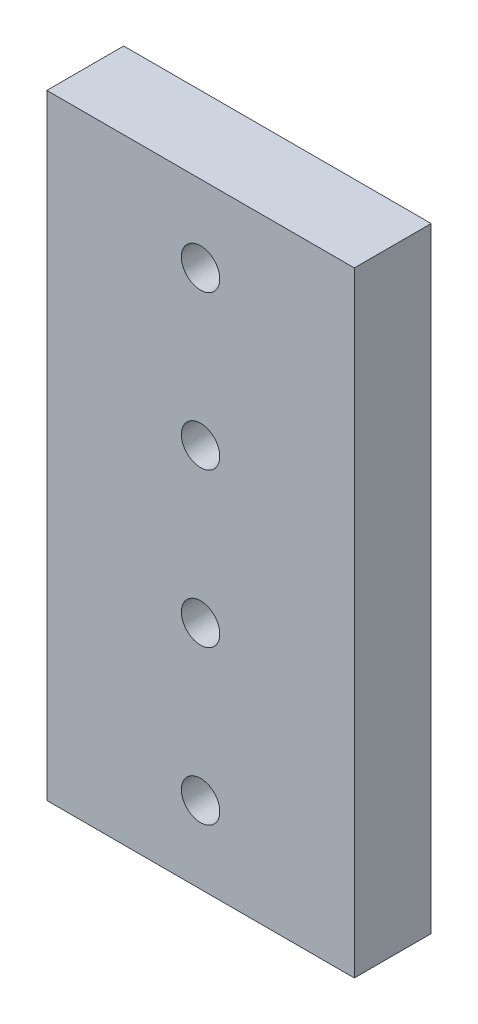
ISO-10303-21;
HEADER;
FILE_DESCRIPTION(('STEP AP214'),'2;1');
FILE_NAME('part.step','',(''),(''),'','','');
FILE_SCHEMA(('AUTOMOTIVE_DESIGN { 1 0 10303 214 1 1 1 1 }'));
ENDSEC;
DATA;
#1=APPLICATION_CONTEXT('core data for automotive mechanical design processes');
#2=APPLICATION_PROTOCOL_DEFINITION('international standard','automotive_design',2000,#1);
#3=PRODUCT_CONTEXT('',#1,'mechanical');
#4=PRODUCT('Part','Part','',(#3));
#5=PRODUCT_RELATED_PRODUCT_CATEGORY('part','',(#4));
#6=PRODUCT_DEFINITION_FORMATION('','',#4);
#7=PRODUCT_DEFINITION_CONTEXT('part definition',#1,'design');
#8=PRODUCT_DEFINITION('design','',#6,#7);
#9=PRODUCT_DEFINITION_SHAPE('','',#8);
#10=(LENGTH_UNIT() NAMED_UNIT(*) SI_UNIT(.MILLI.,.METRE.));
#11=(NAMED_UNIT(*) PLANE_ANGLE_UNIT() SI_UNIT($,.RADIAN.));
#12=(NAMED_UNIT(*) SI_UNIT($,.STERADIAN.) SOLID_ANGLE_UNIT());
#13=UNCERTAINTY_MEASURE_WITH_UNIT(LENGTH_MEASURE(1.E-05),#10,'distance_accuracy_value','');
#14=(GEOMETRIC_REPRESENTATION_CONTEXT(3) GLOBAL_UNCERTAINTY_ASSIGNED_CONTEXT((#13)) GLOBAL_UNIT_ASSIGNED_CONTEXT((#10,
#11,#12)) REPRESENTATION_CONTEXT('',''));
#15=CARTESIAN_POINT('',(0.,0.,0.));
#16=DIRECTION('',(0.,0.,1.));
#17=DIRECTION('',(1.,0.,0.));
#18=AXIS2_PLACEMENT_3D('',#15,#16,#17);
#19=CARTESIAN_POINT('',(12.7,-25.4,3.175));
#20=DIRECTION('',(-1.,0.,0.));
#21=DIRECTION('',(0.,0.,1.));
#22=AXIS2_PLACEMENT_3D('',#19,#20,#21);
#23=PLANE('',#22);
#24=DIRECTION('',(0.,1.,0.));
#25=VECTOR('',#24,1.);
#26=CARTESIAN_POINT('',(12.7,-25.4,-3.175));
#27=LINE('',#26,#25);
#28=CARTESIAN_POINT('',(12.7,-25.4,-3.175));
#29=VERTEX_POINT('',#28);
#30=CARTESIAN_POINT('',(12.7,25.4,-3.175));
#31=VERTEX_POINT('',#30);
#32=EDGE_CURVE('E102',#29,#31,#27,.T.);
#33=ORIENTED_EDGE('',*,*,#32,.T.);
#34=DIRECTION('',(0.,0.,-1.));
#35=VECTOR('',#34,1.);
#36=CARTESIAN_POINT('',(12.7,25.4,3.175));
#37=LINE('',#36,#35);
#38=CARTESIAN_POINT('',(12.7,25.4,3.175));
#39=VERTEX_POINT('',#38);
#40=EDGE_CURVE('E93',#39,#31,#37,.T.);
#41=ORIENTED_EDGE('',*,*,#40,.F.);
#42=DIRECTION('',(0.,1.,0.));
#43=VECTOR('',#42,1.);
#44=CARTESIAN_POINT('',(12.7,-25.4,3.175));
#45=LINE('',#44,#43);
#46=CARTESIAN_POINT('',(12.7,-25.4,3.175));
#47=VERTEX_POINT('',#46);
#48=EDGE_CURVE('E87',#47,#39,#45,.T.);
#49=ORIENTED_EDGE('',*,*,#48,.F.);
#50=DIRECTION('',(0.,0.,-1.));
#51=VECTOR('',#50,1.);
#52=CARTESIAN_POINT('',(12.7,-25.4,3.175));
#53=LINE('',#52,#51);
#54=EDGE_CURVE('E98',#47,#29,#53,.T.);
#55=ORIENTED_EDGE('',*,*,#54,.T.);
#56=EDGE_LOOP('',(#33,#41,#49,#55));
#57=FACE_BOUND('',#56,.T.);
#58=ADVANCED_FACE('F33',(#57),#23,.F.);
#59=CARTESIAN_POINT('',(-12.7,25.4,3.175));
#60=DIRECTION('',(0.,-1.,0.));
#61=DIRECTION('',(0.,0.,-1.));
#62=AXIS2_PLACEMENT_3D('',#59,#60,#61);
#63=PLANE('',#62);
#64=DIRECTION('',(-1.,0.,0.));
#65=VECTOR('',#64,1.);
#66=CARTESIAN_POINT('',(-12.7,25.4,-3.175));
#67=LINE('',#66,#65);
#68=CARTESIAN_POINT('',(-12.7,25.4,-3.175));
#69=VERTEX_POINT('',#68);
#70=EDGE_CURVE('E92',#31,#69,#67,.T.);
#71=ORIENTED_EDGE('',*,*,#70,.T.);
#72=DIRECTION('',(0.,0.,-1.));
#73=VECTOR('',#72,1.);
#74=CARTESIAN_POINT('',(-12.7,25.4,3.175));
#75=LINE('',#74,#73);
#76=CARTESIAN_POINT('',(-12.7,25.4,3.175));
#77=VERTEX_POINT('',#76);
#78=EDGE_CURVE('E90',#77,#69,#75,.T.);
#79=ORIENTED_EDGE('',*,*,#78,.F.);
#80=DIRECTION('',(-1.,0.,0.));
#81=VECTOR('',#80,1.);
#82=CARTESIAN_POINT('',(-12.7,25.4,3.175));
#83=LINE('',#82,#81);
#84=EDGE_CURVE('E81',#39,#77,#83,.T.);
#85=ORIENTED_EDGE('',*,*,#84,.F.);
#86=ORIENTED_EDGE('',*,*,#40,.T.);
#87=EDGE_LOOP('',(#71,#79,#85,#86));
#88=FACE_BOUND('',#87,.T.);
#89=ADVANCED_FACE('F91',(#88),#63,.F.);
#90=CARTESIAN_POINT('',(-12.7,-25.4,3.175));
#91=DIRECTION('',(1.,0.,0.));
#92=DIRECTION('',(0.,0.,-1.));
#93=AXIS2_PLACEMENT_3D('',#90,#91,#92);
#94=PLANE('',#93);
#95=DIRECTION('',(0.,-1.,0.));
#96=VECTOR('',#95,1.);
#97=CARTESIAN_POINT('',(-12.7,-25.4,-3.175));
#98=LINE('',#97,#96);
#99=CARTESIAN_POINT('',(-12.7,-25.4,-3.175));
#100=VERTEX_POINT('',#99);
#101=EDGE_CURVE('E67',#69,#100,#98,.T.);
#102=ORIENTED_EDGE('',*,*,#101,.T.);
#103=DIRECTION('',(0.,0.,-1.));
#104=VECTOR('',#103,1.);
#105=CARTESIAN_POINT('',(-12.7,-25.4,3.175));
#106=LINE('',#105,#104);
#107=CARTESIAN_POINT('',(-12.7,-25.4,3.175));
#108=VERTEX_POINT('',#107);
#109=EDGE_CURVE('E94',#108,#100,#106,.T.);
#110=ORIENTED_EDGE('',*,*,#109,.F.);
#111=DIRECTION('',(0.,-1.,0.));
#112=VECTOR('',#111,1.);
#113=CARTESIAN_POINT('',(-12.7,-25.4,3.175));
#114=LINE('',#113,#112);
#115=EDGE_CURVE('E85',#77,#108,#114,.T.);
#116=ORIENTED_EDGE('',*,*,#115,.F.);
#117=ORIENTED_EDGE('',*,*,#78,.T.);
#118=EDGE_LOOP('',(#102,#110,#116,#117));
#119=FACE_BOUND('',#118,.T.);
#120=ADVANCED_FACE('F96',(#119),#94,.F.);
#121=CARTESIAN_POINT('',(-12.7,-25.4,3.175));
#122=DIRECTION('',(0.,1.,0.));
#123=DIRECTION('',(0.,0.,1.));
#124=AXIS2_PLACEMENT_3D('',#121,#122,#123);
#125=PLANE('',#124);
#126=DIRECTION('',(1.,0.,0.));
#127=VECTOR('',#126,1.);
#128=CARTESIAN_POINT('',(-12.7,-25.4,-3.175));
#129=LINE('',#128,#127);
#130=EDGE_CURVE('E73',#100,#29,#129,.T.);
#131=ORIENTED_EDGE('',*,*,#130,.T.);
#132=ORIENTED_EDGE('',*,*,#54,.F.);
#133=DIRECTION('',(1.,0.,0.));
#134=VECTOR('',#133,1.);
#135=CARTESIAN_POINT('',(-12.7,-25.4,3.175));
#136=LINE('',#135,#134);
#137=EDGE_CURVE('E50',#108,#47,#136,.T.);
#138=ORIENTED_EDGE('',*,*,#137,.F.);
#139=ORIENTED_EDGE('',*,*,#109,.T.);
#140=EDGE_LOOP('',(#131,#132,#138,#139));
#141=FACE_BOUND('',#140,.T.);
#142=ADVANCED_FACE('F138',(#141),#125,.F.);
#143=CARTESIAN_POINT('',(0.,0.,3.175));
#144=DIRECTION('',(0.,0.,-1.));
#145=DIRECTION('',(-1.,0.,0.));
#146=AXIS2_PLACEMENT_3D('',#143,#144,#145);
#147=PLANE('',#146);
#148=CARTESIAN_POINT('',(0.,6.35,3.175));
#149=DIRECTION('',(0.,0.,-1.));
#150=DIRECTION('',(-1.,0.,0.));
#151=AXIS2_PLACEMENT_3D('',#148,#149,#150);
#152=CIRCLE('',#151,1.5875);
#153=CARTESIAN_POINT('',(-1.5875,6.35,3.175));
#154=VERTEX_POINT('',#153);
#155=EDGE_CURVE('E168',#154,#154,#152,.T.);
#156=ORIENTED_EDGE('',*,*,#155,.T.);
#157=EDGE_LOOP('',(#156));
#158=FACE_BOUND('',#157,.T.);
#159=CARTESIAN_POINT('',(0.,19.05,3.175));
#160=DIRECTION('',(0.,0.,-1.));
#161=DIRECTION('',(-1.,0.,0.));
#162=AXIS2_PLACEMENT_3D('',#159,#160,#161);
#163=CIRCLE('',#162,1.5875);
#164=CARTESIAN_POINT('',(-1.5875,19.05,3.175));
#165=VERTEX_POINT('',#164);
#166=EDGE_CURVE('E105',#165,#165,#163,.T.);
#167=ORIENTED_EDGE('',*,*,#166,.T.);
#168=EDGE_LOOP('',(#167));
#169=FACE_BOUND('',#168,.T.);
#170=ORIENTED_EDGE('',*,*,#48,.T.);
#171=ORIENTED_EDGE('',*,*,#84,.T.);
#172=ORIENTED_EDGE('',*,*,#115,.T.);
#173=ORIENTED_EDGE('',*,*,#137,.T.);
#174=EDGE_LOOP('',(#170,#171,#172,#173));
#175=FACE_BOUND('',#174,.T.);
#176=CARTESIAN_POINT('',(0.,-6.35,3.175));
#177=DIRECTION('',(0.,0.,-1.));
#178=DIRECTION('',(-1.,0.,0.));
#179=AXIS2_PLACEMENT_3D('',#176,#177,#178);
#180=CIRCLE('',#179,1.5875);
#181=CARTESIAN_POINT('',(-1.5875,-6.35,3.175));
#182=VERTEX_POINT('',#181);
#183=EDGE_CURVE('E112',#182,#182,#180,.T.);
#184=ORIENTED_EDGE('',*,*,#183,.T.);
#185=EDGE_LOOP('',(#184));
#186=FACE_BOUND('',#185,.T.);
#187=CARTESIAN_POINT('',(0.,-19.05,3.175));
#188=DIRECTION('',(0.,0.,-1.));
#189=DIRECTION('',(-1.,0.,0.));
#190=AXIS2_PLACEMENT_3D('',#187,#188,#189);
#191=CIRCLE('',#190,1.5875);
#192=CARTESIAN_POINT('',(-1.5875,-19.05,3.175));
#193=VERTEX_POINT('',#192);
#194=EDGE_CURVE('E42',#193,#193,#191,.T.);
#195=ORIENTED_EDGE('',*,*,#194,.T.);
#196=EDGE_LOOP('',(#195));
#197=FACE_BOUND('',#196,.T.);
#198=ADVANCED_FACE('F82',(#158,#169,#175,#186,#197),#147,.F.);
#199=CARTESIAN_POINT('',(0.,0.,-3.175));
#200=DIRECTION('',(0.,0.,-1.));
#201=DIRECTION('',(-1.,0.,0.));
#202=AXIS2_PLACEMENT_3D('',#199,#200,#201);
#203=PLANE('',#202);
#204=CARTESIAN_POINT('',(0.,6.35,-3.175));
#205=DIRECTION('',(0.,0.,-1.));
#206=DIRECTION('',(-1.,0.,0.));
#207=AXIS2_PLACEMENT_3D('',#204,#205,#206);
#208=CIRCLE('',#207,1.5875);
#209=CARTESIAN_POINT('',(-1.5875,6.35,-3.175));
#210=VERTEX_POINT('',#209);
#211=EDGE_CURVE('E170',#210,#210,#208,.T.);
#212=ORIENTED_EDGE('',*,*,#211,.F.);
#213=EDGE_LOOP('',(#212));
#214=FACE_BOUND('',#213,.T.);
#215=CARTESIAN_POINT('',(0.,19.05,-3.175));
#216=DIRECTION('',(0.,0.,-1.));
#217=DIRECTION('',(-1.,0.,0.));
#218=AXIS2_PLACEMENT_3D('',#215,#216,#217);
#219=CIRCLE('',#218,1.5875);
#220=CARTESIAN_POINT('',(-1.5875,19.05,-3.175));
#221=VERTEX_POINT('',#220);
#222=EDGE_CURVE('E171',#221,#221,#219,.T.);
#223=ORIENTED_EDGE('',*,*,#222,.F.);
#224=EDGE_LOOP('',(#223));
#225=FACE_BOUND('',#224,.T.);
#226=ORIENTED_EDGE('',*,*,#32,.F.);
#227=ORIENTED_EDGE('',*,*,#130,.F.);
#228=ORIENTED_EDGE('',*,*,#101,.F.);
#229=ORIENTED_EDGE('',*,*,#70,.F.);
#230=EDGE_LOOP('',(#226,#227,#228,#229));
#231=FACE_BOUND('',#230,.T.);
#232=CARTESIAN_POINT('',(0.,-6.35,-3.175));
#233=DIRECTION('',(0.,0.,-1.));
#234=DIRECTION('',(-1.,0.,0.));
#235=AXIS2_PLACEMENT_3D('',#232,#233,#234);
#236=CIRCLE('',#235,1.5875);
#237=CARTESIAN_POINT('',(-1.5875,-6.35,-3.175));
#238=VERTEX_POINT('',#237);
#239=EDGE_CURVE('E115',#238,#238,#236,.T.);
#240=ORIENTED_EDGE('',*,*,#239,.F.);
#241=EDGE_LOOP('',(#240));
#242=FACE_BOUND('',#241,.T.);
#243=CARTESIAN_POINT('',(0.,-19.05,-3.175));
#244=DIRECTION('',(0.,0.,-1.));
#245=DIRECTION('',(-1.,0.,0.));
#246=AXIS2_PLACEMENT_3D('',#243,#244,#245);
#247=CIRCLE('',#246,1.5875);
#248=CARTESIAN_POINT('',(-1.5875,-19.05,-3.175));
#249=VERTEX_POINT('',#248);
#250=EDGE_CURVE('E11',#249,#249,#247,.T.);
#251=ORIENTED_EDGE('',*,*,#250,.F.);
#252=EDGE_LOOP('',(#251));
#253=FACE_BOUND('',#252,.T.);
#254=ADVANCED_FACE('F126',(#214,#225,#231,#242,#253),#203,.T.);
#255=CARTESIAN_POINT('',(0.,19.05,3.175));
#256=DIRECTION('',(0.,0.,-1.));
#257=DIRECTION('',(-1.,0.,0.));
#258=AXIS2_PLACEMENT_3D('',#255,#256,#257);
#259=CYLINDRICAL_SURFACE('',#258,1.5875);
#260=ORIENTED_EDGE('',*,*,#166,.F.);
#261=EDGE_LOOP('',(#260));
#262=FACE_BOUND('',#261,.T.);
#263=ORIENTED_EDGE('',*,*,#222,.T.);
#264=EDGE_LOOP('',(#263));
#265=FACE_BOUND('',#264,.T.);
#266=ADVANCED_FACE('F128',(#262,#265),#259,.F.);
#267=CARTESIAN_POINT('',(0.,6.35,3.175));
#268=DIRECTION('',(0.,0.,-1.));
#269=DIRECTION('',(-1.,0.,0.));
#270=AXIS2_PLACEMENT_3D('',#267,#268,#269);
#271=CYLINDRICAL_SURFACE('',#270,1.5875);
#272=ORIENTED_EDGE('',*,*,#155,.F.);
#273=EDGE_LOOP('',(#272));
#274=FACE_BOUND('',#273,.T.);
#275=ORIENTED_EDGE('',*,*,#211,.T.);
#276=EDGE_LOOP('',(#275));
#277=FACE_BOUND('',#276,.T.);
#278=ADVANCED_FACE('F135',(#274,#277),#271,.F.);
#279=CARTESIAN_POINT('',(0.,-6.35,3.175));
#280=DIRECTION('',(0.,0.,-1.));
#281=DIRECTION('',(-1.,0.,0.));
#282=AXIS2_PLACEMENT_3D('',#279,#280,#281);
#283=CYLINDRICAL_SURFACE('',#282,1.5875);
#284=ORIENTED_EDGE('',*,*,#183,.F.);
#285=EDGE_LOOP('',(#284));
#286=FACE_BOUND('',#285,.T.);
#287=ORIENTED_EDGE('',*,*,#239,.T.);
#288=EDGE_LOOP('',(#287));
#289=FACE_BOUND('',#288,.T.);
#290=ADVANCED_FACE('F123',(#286,#289),#283,.F.);
#291=CARTESIAN_POINT('',(0.,-19.05,3.175));
#292=DIRECTION('',(0.,0.,-1.));
#293=DIRECTION('',(-1.,0.,0.));
#294=AXIS2_PLACEMENT_3D('',#291,#292,#293);
#295=CYLINDRICAL_SURFACE('',#294,1.5875);
#296=ORIENTED_EDGE('',*,*,#194,.F.);
#297=EDGE_LOOP('',(#296));
#298=FACE_BOUND('',#297,.T.);
#299=ORIENTED_EDGE('',*,*,#250,.T.);
#300=EDGE_LOOP('',(#299));
#301=FACE_BOUND('',#300,.T.);
#302=ADVANCED_FACE('F35',(#298,#301),#295,.F.);
#303=CLOSED_SHELL('',(#58,#89,#120,#142,#198,#254,#266,#278,#290,#302));
#304=MANIFOLD_SOLID_BREP('B2',#303);
#305=ADVANCED_BREP_SHAPE_REPRESENTATION('',(#18,#304),#14);
#306=SHAPE_DEFINITION_REPRESENTATION(#9,#305);
ENDSEC;
END-ISO-10303-21;
